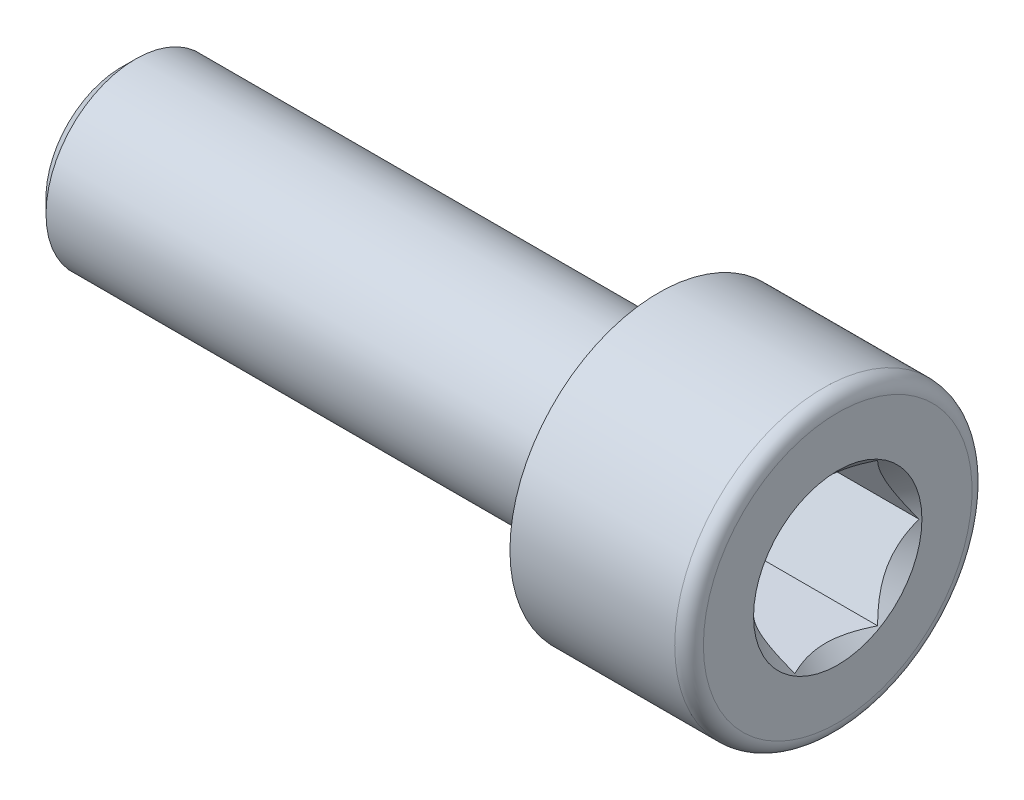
from build123d import *

# Parameters (mm, degrees)
CHANFREIN1_SIZE         = 0.4
ENL_V_MAT_EXTRU_1_DEPTH = 3.5


with BuildPart() as part:
    # Esquisse1 → Base-R_volution (revolve)
    with BuildSketch(Plane.XY, mode=Mode.PRIVATE) as base_r_volution_sk:
        with BuildLine():
            Line((0, 2.5), (0, 4.15))
            Line((0, 4.15), (4.6, 4.15))
            ThreePointArc((4.6, 4.15), (4.882842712, 4.032842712), (5, 3.75))
            Line((5, 3.75), (5, 2.35))
            Line((5, 2.35), (4.65, 2))
            Line((4.65, 2), (1.6, 2))
            Line((1.6, 2), (0.445299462, 0))
            Line((0.445299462, 0), (-15, 0))
            Line((-15, 0), (-15, 2.5))
            Line((-15, 2.5), (0, 2.5))
        make_face()
    revolve(base_r_volution_sk.sketch.rotate(Axis((-30, 0, 0), (1, 0, 0)), 90), axis=Axis((-30, 0, 0), (1, 0, 0)))

    # Chanfrein1
    chanfrein1_edges = [part.edges().sort_by_distance(p)[0] for p in [
        (-15, 0, -2.5),
    ]]
    chamfer(chanfrein1_edges, length=CHANFREIN1_SIZE)

    # Esquisse2 → Enl_v. mat.-Extru.1 (cut)
    with BuildSketch(Plane(origin=(5, 0, 0), x_dir=(0, 0, -1), z_dir=(1, 0, 0))):
        Polygon((-2.309401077, 0), (-1.154700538, -2), (1.154700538, -2), (2.309401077, 0), (1.154700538, 2), (-1.154700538, 2), align=None)
    extrude(amount=-ENL_V_MAT_EXTRU_1_DEPTH, mode=Mode.SUBTRACT)


solid = part.part
